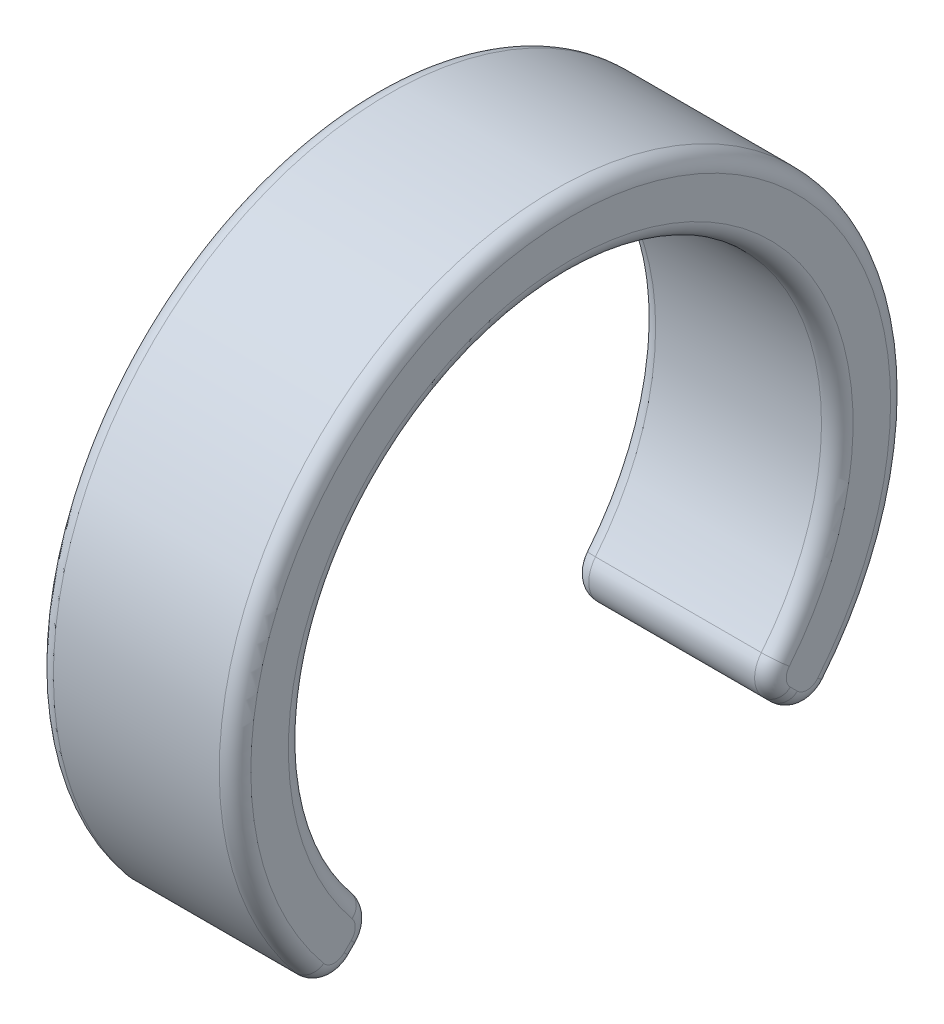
ISO-10303-21;
HEADER;
FILE_DESCRIPTION(('STEP AP214'),'2;1');
FILE_NAME('part.step','',(''),(''),'','','');
FILE_SCHEMA(('AUTOMOTIVE_DESIGN { 1 0 10303 214 1 1 1 1 }'));
ENDSEC;
DATA;
#1=APPLICATION_CONTEXT('core data for automotive mechanical design processes');
#2=APPLICATION_PROTOCOL_DEFINITION('international standard','automotive_design',2000,#1);
#3=PRODUCT_CONTEXT('',#1,'mechanical');
#4=PRODUCT('Part','Part','',(#3));
#5=PRODUCT_RELATED_PRODUCT_CATEGORY('part','',(#4));
#6=PRODUCT_DEFINITION_FORMATION('','',#4);
#7=PRODUCT_DEFINITION_CONTEXT('part definition',#1,'design');
#8=PRODUCT_DEFINITION('design','',#6,#7);
#9=PRODUCT_DEFINITION_SHAPE('','',#8);
#10=(LENGTH_UNIT() NAMED_UNIT(*) SI_UNIT(.MILLI.,.METRE.));
#11=(NAMED_UNIT(*) PLANE_ANGLE_UNIT() SI_UNIT($,.RADIAN.));
#12=(NAMED_UNIT(*) SI_UNIT($,.STERADIAN.) SOLID_ANGLE_UNIT());
#13=UNCERTAINTY_MEASURE_WITH_UNIT(LENGTH_MEASURE(1.E-05),#10,'distance_accuracy_value','');
#14=(GEOMETRIC_REPRESENTATION_CONTEXT(3) GLOBAL_UNCERTAINTY_ASSIGNED_CONTEXT((#13)) GLOBAL_UNIT_ASSIGNED_CONTEXT((#10,
#11,#12)) REPRESENTATION_CONTEXT('',''));
#15=CARTESIAN_POINT('',(0.,0.,0.));
#16=DIRECTION('',(0.,0.,1.));
#17=DIRECTION('',(1.,0.,0.));
#18=AXIS2_PLACEMENT_3D('',#15,#16,#17);
#19=CARTESIAN_POINT('',(5.,-12.0208152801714,12.0208152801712));
#20=DIRECTION('',(-1.,0.,0.));
#21=DIRECTION('',(0.,0.,1.));
#22=AXIS2_PLACEMENT_3D('',#19,#20,#21);
#23=PLANE('',#22);
#24=CARTESIAN_POINT('',(5.,0.,0.));
#25=DIRECTION('',(-1.,0.,0.));
#26=DIRECTION('',(0.,0.,1.));
#27=AXIS2_PLACEMENT_3D('',#24,#25,#26);
#28=CIRCLE('',#27,16.2);
#29=CARTESIAN_POINT('',(5.,-10.2928026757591,-12.5099245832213));
#30=VERTEX_POINT('',#29);
#31=CARTESIAN_POINT('',(5.,-10.2928026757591,12.5099245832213));
#32=VERTEX_POINT('',#31);
#33=EDGE_CURVE('E153',#30,#32,#28,.F.);
#34=ORIENTED_EDGE('',*,*,#33,.T.);
#35=CARTESIAN_POINT('',(5.,-9.84805194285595,11.9693722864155));
#36=DIRECTION('',(-1.,0.,0.));
#37=DIRECTION('',(0.,0.,1.));
#38=AXIS2_PLACEMENT_3D('',#35,#36,#37);
#39=CIRCLE('',#38,0.7);
#40=CARTESIAN_POINT('',(5.,-10.3430266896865,11.4743975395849));
#41=VERTEX_POINT('',#40);
#42=EDGE_CURVE('E190',#32,#41,#39,.F.);
#43=ORIENTED_EDGE('',*,*,#42,.T.);
#44=DIRECTION('',(0.,-0.707106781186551,0.707106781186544));
#45=VECTOR('',#44,1.);
#46=CARTESIAN_POINT('',(5.,-11.4551298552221,12.5865007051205));
#47=LINE('',#46,#45);
#48=CARTESIAN_POINT('',(5.,-9.98775003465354,11.1191208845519));
#49=VERTEX_POINT('',#48);
#50=EDGE_CURVE('E188',#41,#49,#47,.F.);
#51=ORIENTED_EDGE('',*,*,#50,.T.);
#52=CARTESIAN_POINT('',(5.,-9.49277528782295,11.6140956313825));
#53=DIRECTION('',(-1.,0.,0.));
#54=DIRECTION('',(0.,0.,1.));
#55=AXIS2_PLACEMENT_3D('',#52,#53,#54);
#56=CIRCLE('',#55,0.7);
#57=CARTESIAN_POINT('',(5.,-9.04977910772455,11.072104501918));
#58=VERTEX_POINT('',#57);
#59=EDGE_CURVE('E186',#49,#58,#56,.F.);
#60=ORIENTED_EDGE('',*,*,#59,.T.);
#61=CARTESIAN_POINT('',(5.,0.,0.));
#62=DIRECTION('',(-1.,0.,0.));
#63=DIRECTION('',(0.,0.,1.));
#64=AXIS2_PLACEMENT_3D('',#61,#62,#63);
#65=CIRCLE('',#64,14.3);
#66=CARTESIAN_POINT('',(5.,-9.04977910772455,-11.072104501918));
#67=VERTEX_POINT('',#66);
#68=EDGE_CURVE('E184',#58,#67,#65,.T.);
#69=ORIENTED_EDGE('',*,*,#68,.T.);
#70=CARTESIAN_POINT('',(5.,-9.49277528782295,-11.6140956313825));
#71=DIRECTION('',(-1.,0.,0.));
#72=DIRECTION('',(0.,0.,1.));
#73=AXIS2_PLACEMENT_3D('',#70,#71,#72);
#74=CIRCLE('',#73,0.7);
#75=CARTESIAN_POINT('',(5.,-9.98775003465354,-11.1191208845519));
#76=VERTEX_POINT('',#75);
#77=EDGE_CURVE('E182',#67,#76,#74,.F.);
#78=ORIENTED_EDGE('',*,*,#77,.T.);
#79=DIRECTION('',(0.,-0.707106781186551,-0.707106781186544));
#80=VECTOR('',#79,1.);
#81=CARTESIAN_POINT('',(5.,-10.3430266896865,-11.4743975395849));
#82=LINE('',#81,#80);
#83=CARTESIAN_POINT('',(5.,-10.3430266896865,-11.4743975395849));
#84=VERTEX_POINT('',#83);
#85=EDGE_CURVE('E156',#76,#84,#82,.T.);
#86=ORIENTED_EDGE('',*,*,#85,.T.);
#87=CARTESIAN_POINT('',(5.,-9.84805194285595,-11.9693722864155));
#88=DIRECTION('',(-1.,0.,0.));
#89=DIRECTION('',(0.,0.,1.));
#90=AXIS2_PLACEMENT_3D('',#87,#88,#89);
#91=CIRCLE('',#90,0.7);
#92=EDGE_CURVE('E149',#84,#30,#91,.F.);
#93=ORIENTED_EDGE('',*,*,#92,.T.);
#94=EDGE_LOOP('',(#34,#43,#51,#60,#69,#78,#86,#93));
#95=FACE_BOUND('',#94,.T.);
#96=ADVANCED_FACE('F34',(#95),#23,.F.);
#97=CARTESIAN_POINT('',(-29.230918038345,0.,0.));
#98=DIRECTION('',(-1.,0.,0.));
#99=DIRECTION('',(0.,0.,1.));
#100=AXIS2_PLACEMENT_3D('',#97,#98,#99);
#101=CYLINDRICAL_SURFACE('',#100,13.5);
#102=DIRECTION('',(-1.,0.,0.));
#103=VECTOR('',#102,1.);
#104=CARTESIAN_POINT('',(-29.230918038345,-8.54349775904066,-10.4526860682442));
#105=LINE('',#104,#103);
#106=CARTESIAN_POINT('',(-4.2,-8.54349775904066,-10.4526860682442));
#107=VERTEX_POINT('',#106);
#108=CARTESIAN_POINT('',(4.2,-8.54349775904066,-10.4526860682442));
#109=VERTEX_POINT('',#108);
#110=EDGE_CURVE('E305',#107,#109,#105,.F.);
#111=ORIENTED_EDGE('',*,*,#110,.T.);
#112=CARTESIAN_POINT('',(4.2,0.,0.));
#113=DIRECTION('',(-1.,0.,0.));
#114=DIRECTION('',(0.,0.,1.));
#115=AXIS2_PLACEMENT_3D('',#112,#113,#114);
#116=CIRCLE('',#115,13.5);
#117=CARTESIAN_POINT('',(4.2,-8.54349775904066,10.4526860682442));
#118=VERTEX_POINT('',#117);
#119=EDGE_CURVE('E208',#109,#118,#116,.F.);
#120=ORIENTED_EDGE('',*,*,#119,.T.);
#121=DIRECTION('',(-1.,0.,0.));
#122=VECTOR('',#121,1.);
#123=CARTESIAN_POINT('',(-29.230918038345,-8.54349775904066,10.4526860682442));
#124=LINE('',#123,#122);
#125=CARTESIAN_POINT('',(-4.2,-8.54349775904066,10.4526860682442));
#126=VERTEX_POINT('',#125);
#127=EDGE_CURVE('E302',#118,#126,#124,.T.);
#128=ORIENTED_EDGE('',*,*,#127,.T.);
#129=CARTESIAN_POINT('',(-4.2,0.,0.));
#130=DIRECTION('',(1.,0.,0.));
#131=DIRECTION('',(0.,0.,-1.));
#132=AXIS2_PLACEMENT_3D('',#129,#130,#131);
#133=CIRCLE('',#132,13.5);
#134=EDGE_CURVE('E206',#126,#107,#133,.F.);
#135=ORIENTED_EDGE('',*,*,#134,.T.);
#136=EDGE_LOOP('',(#111,#120,#128,#135));
#137=FACE_BOUND('',#136,.T.);
#138=ADVANCED_FACE('F336',(#137),#101,.F.);
#139=CARTESIAN_POINT('',(-5.,-12.0208152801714,12.0208152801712));
#140=DIRECTION('',(1.,0.,0.));
#141=DIRECTION('',(0.,0.,-1.));
#142=AXIS2_PLACEMENT_3D('',#139,#140,#141);
#143=PLANE('',#142);
#144=CARTESIAN_POINT('',(-5.,0.,0.));
#145=DIRECTION('',(1.,0.,0.));
#146=DIRECTION('',(0.,0.,-1.));
#147=AXIS2_PLACEMENT_3D('',#144,#145,#146);
#148=CIRCLE('',#147,14.3);
#149=CARTESIAN_POINT('',(-5.,-9.04977910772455,-11.072104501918));
#150=VERTEX_POINT('',#149);
#151=CARTESIAN_POINT('',(-5.,-9.04977910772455,11.072104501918));
#152=VERTEX_POINT('',#151);
#153=EDGE_CURVE('E221',#150,#152,#148,.T.);
#154=ORIENTED_EDGE('',*,*,#153,.T.);
#155=CARTESIAN_POINT('',(-5.,-9.49277528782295,11.6140956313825));
#156=DIRECTION('',(1.,0.,0.));
#157=DIRECTION('',(0.,0.,-1.));
#158=AXIS2_PLACEMENT_3D('',#155,#156,#157);
#159=CIRCLE('',#158,0.7);
#160=CARTESIAN_POINT('',(-5.,-9.98775003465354,11.1191208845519));
#161=VERTEX_POINT('',#160);
#162=EDGE_CURVE('E234',#152,#161,#159,.F.);
#163=ORIENTED_EDGE('',*,*,#162,.T.);
#164=DIRECTION('',(0.,0.707106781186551,-0.707106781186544));
#165=VECTOR('',#164,1.);
#166=CARTESIAN_POINT('',(-5.,-11.4551298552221,12.5865007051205));
#167=LINE('',#166,#165);
#168=CARTESIAN_POINT('',(-5.,-10.3430266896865,11.4743975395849));
#169=VERTEX_POINT('',#168);
#170=EDGE_CURVE('E58',#161,#169,#167,.F.);
#171=ORIENTED_EDGE('',*,*,#170,.T.);
#172=CARTESIAN_POINT('',(-5.,-9.84805194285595,11.9693722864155));
#173=DIRECTION('',(1.,0.,0.));
#174=DIRECTION('',(0.,0.,-1.));
#175=AXIS2_PLACEMENT_3D('',#172,#173,#174);
#176=CIRCLE('',#175,0.7);
#177=CARTESIAN_POINT('',(-5.,-10.2928026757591,12.5099245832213));
#178=VERTEX_POINT('',#177);
#179=EDGE_CURVE('E231',#169,#178,#176,.F.);
#180=ORIENTED_EDGE('',*,*,#179,.T.);
#181=CARTESIAN_POINT('',(-5.,0.,0.));
#182=DIRECTION('',(1.,0.,0.));
#183=DIRECTION('',(0.,0.,-1.));
#184=AXIS2_PLACEMENT_3D('',#181,#182,#183);
#185=CIRCLE('',#184,16.2);
#186=CARTESIAN_POINT('',(-5.,-10.2928026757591,-12.5099245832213));
#187=VERTEX_POINT('',#186);
#188=EDGE_CURVE('E229',#178,#187,#185,.F.);
#189=ORIENTED_EDGE('',*,*,#188,.T.);
#190=CARTESIAN_POINT('',(-5.,-9.84805194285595,-11.9693722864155));
#191=DIRECTION('',(1.,0.,0.));
#192=DIRECTION('',(0.,0.,-1.));
#193=AXIS2_PLACEMENT_3D('',#190,#191,#192);
#194=CIRCLE('',#193,0.7);
#195=CARTESIAN_POINT('',(-5.,-10.3430266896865,-11.4743975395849));
#196=VERTEX_POINT('',#195);
#197=EDGE_CURVE('E227',#187,#196,#194,.F.);
#198=ORIENTED_EDGE('',*,*,#197,.T.);
#199=DIRECTION('',(0.,0.707106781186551,0.707106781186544));
#200=VECTOR('',#199,1.);
#201=CARTESIAN_POINT('',(-5.,-9.98775003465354,-11.1191208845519));
#202=LINE('',#201,#200);
#203=CARTESIAN_POINT('',(-5.,-9.98775003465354,-11.1191208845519));
#204=VERTEX_POINT('',#203);
#205=EDGE_CURVE('E225',#196,#204,#202,.T.);
#206=ORIENTED_EDGE('',*,*,#205,.T.);
#207=CARTESIAN_POINT('',(-5.,-9.49277528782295,-11.6140956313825));
#208=DIRECTION('',(1.,0.,0.));
#209=DIRECTION('',(0.,0.,-1.));
#210=AXIS2_PLACEMENT_3D('',#207,#208,#209);
#211=CIRCLE('',#210,0.7);
#212=EDGE_CURVE('E223',#204,#150,#211,.F.);
#213=ORIENTED_EDGE('',*,*,#212,.T.);
#214=EDGE_LOOP('',(#154,#163,#171,#180,#189,#198,#206,#213));
#215=FACE_BOUND('',#214,.T.);
#216=ADVANCED_FACE('F322',(#215),#143,.F.);
#217=CARTESIAN_POINT('',(-29.230918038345,0.,0.));
#218=DIRECTION('',(-1.,0.,0.));
#219=DIRECTION('',(0.,0.,1.));
#220=AXIS2_PLACEMENT_3D('',#217,#218,#219);
#221=CYLINDRICAL_SURFACE('',#220,17.);
#222=DIRECTION('',(-1.,0.,0.));
#223=VECTOR('',#222,1.);
#224=CARTESIAN_POINT('',(-29.230918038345,-10.8010892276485,-13.1276986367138));
#225=LINE('',#224,#223);
#226=CARTESIAN_POINT('',(4.2,-10.8010892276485,-13.1276986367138));
#227=VERTEX_POINT('',#226);
#228=CARTESIAN_POINT('',(-4.2,-10.8010892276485,-13.1276986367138));
#229=VERTEX_POINT('',#228);
#230=EDGE_CURVE('E288',#227,#229,#225,.T.);
#231=ORIENTED_EDGE('',*,*,#230,.T.);
#232=CARTESIAN_POINT('',(-4.2,0.,0.));
#233=DIRECTION('',(1.,0.,0.));
#234=DIRECTION('',(0.,0.,-1.));
#235=AXIS2_PLACEMENT_3D('',#232,#233,#234);
#236=CIRCLE('',#235,17.);
#237=CARTESIAN_POINT('',(-4.2,-10.8010892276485,13.1276986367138));
#238=VERTEX_POINT('',#237);
#239=EDGE_CURVE('E11',#229,#238,#236,.T.);
#240=ORIENTED_EDGE('',*,*,#239,.T.);
#241=DIRECTION('',(-1.,0.,0.));
#242=VECTOR('',#241,1.);
#243=CARTESIAN_POINT('',(-29.230918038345,-10.8010892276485,13.1276986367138));
#244=LINE('',#243,#242);
#245=CARTESIAN_POINT('',(4.2,-10.8010892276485,13.1276986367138));
#246=VERTEX_POINT('',#245);
#247=EDGE_CURVE('E252',#238,#246,#244,.F.);
#248=ORIENTED_EDGE('',*,*,#247,.T.);
#249=CARTESIAN_POINT('',(4.2,0.,0.));
#250=DIRECTION('',(-1.,0.,0.));
#251=DIRECTION('',(0.,0.,1.));
#252=AXIS2_PLACEMENT_3D('',#249,#250,#251);
#253=CIRCLE('',#252,17.);
#254=EDGE_CURVE('E43',#246,#227,#253,.T.);
#255=ORIENTED_EDGE('',*,*,#254,.T.);
#256=EDGE_LOOP('',(#231,#240,#248,#255));
#257=FACE_BOUND('',#256,.T.);
#258=ADVANCED_FACE('F292',(#257),#221,.T.);
#259=CARTESIAN_POINT('',(0.,0.,0.));
#260=DIRECTION('',(0.,0.707106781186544,0.707106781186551));
#261=DIRECTION('',(-1.,0.,0.));
#262=AXIS2_PLACEMENT_3D('',#259,#260,#261);
#263=PLANE('',#262);
#264=DIRECTION('',(-1.,0.,0.));
#265=VECTOR('',#264,1.);
#266=CARTESIAN_POINT('',(0.,-10.5534354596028,10.5534354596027));
#267=LINE('',#266,#265);
#268=CARTESIAN_POINT('',(-4.2,-10.5534354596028,10.5534354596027));
#269=VERTEX_POINT('',#268);
#270=CARTESIAN_POINT('',(4.2,-10.5534354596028,10.5534354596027));
#271=VERTEX_POINT('',#270);
#272=EDGE_CURVE('E174',#269,#271,#267,.F.);
#273=ORIENTED_EDGE('',*,*,#272,.T.);
#274=DIRECTION('',(0.,-0.707106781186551,0.707106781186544));
#275=VECTOR('',#274,1.);
#276=CARTESIAN_POINT('',(4.2,0.,0.));
#277=LINE('',#276,#275);
#278=CARTESIAN_POINT('',(4.2,-10.9087121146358,10.9087121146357));
#279=VERTEX_POINT('',#278);
#280=EDGE_CURVE('E199',#271,#279,#277,.T.);
#281=ORIENTED_EDGE('',*,*,#280,.T.);
#282=DIRECTION('',(-1.,0.,0.));
#283=VECTOR('',#282,1.);
#284=CARTESIAN_POINT('',(0.,-10.9087121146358,10.9087121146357));
#285=LINE('',#284,#283);
#286=CARTESIAN_POINT('',(-4.2,-10.9087121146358,10.9087121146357));
#287=VERTEX_POINT('',#286);
#288=EDGE_CURVE('E177',#279,#287,#285,.T.);
#289=ORIENTED_EDGE('',*,*,#288,.T.);
#290=DIRECTION('',(0.,0.707106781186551,-0.707106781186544));
#291=VECTOR('',#290,1.);
#292=CARTESIAN_POINT('',(-4.2,0.,0.));
#293=LINE('',#292,#291);
#294=EDGE_CURVE('E197',#287,#269,#293,.T.);
#295=ORIENTED_EDGE('',*,*,#294,.T.);
#296=EDGE_LOOP('',(#273,#281,#289,#295));
#297=FACE_BOUND('',#296,.T.);
#298=ADVANCED_FACE('F311',(#297),#263,.F.);
#299=CARTESIAN_POINT('',(0.,0.,0.));
#300=DIRECTION('',(0.,-0.707106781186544,0.707106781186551));
#301=DIRECTION('',(-1.,0.,0.));
#302=AXIS2_PLACEMENT_3D('',#299,#300,#301);
#303=PLANE('',#302);
#304=DIRECTION('',(1.,0.,0.));
#305=VECTOR('',#304,1.);
#306=CARTESIAN_POINT('',(5.,-10.9087121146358,-10.9087121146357));
#307=LINE('',#306,#305);
#308=CARTESIAN_POINT('',(-4.2,-10.9087121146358,-10.9087121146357));
#309=VERTEX_POINT('',#308);
#310=CARTESIAN_POINT('',(4.2,-10.9087121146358,-10.9087121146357));
#311=VERTEX_POINT('',#310);
#312=EDGE_CURVE('E290',#309,#311,#307,.T.);
#313=ORIENTED_EDGE('',*,*,#312,.T.);
#314=DIRECTION('',(0.,-0.707106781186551,-0.707106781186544));
#315=VECTOR('',#314,1.);
#316=CARTESIAN_POINT('',(4.2,-10.5534354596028,-10.5534354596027));
#317=LINE('',#316,#315);
#318=CARTESIAN_POINT('',(4.2,-10.5534354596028,-10.5534354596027));
#319=VERTEX_POINT('',#318);
#320=EDGE_CURVE('E216',#311,#319,#317,.F.);
#321=ORIENTED_EDGE('',*,*,#320,.T.);
#322=DIRECTION('',(1.,0.,0.));
#323=VECTOR('',#322,1.);
#324=CARTESIAN_POINT('',(-4.99999999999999,-10.5534354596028,-10.5534354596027));
#325=LINE('',#324,#323);
#326=CARTESIAN_POINT('',(-4.2,-10.5534354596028,-10.5534354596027));
#327=VERTEX_POINT('',#326);
#328=EDGE_CURVE('E295',#319,#327,#325,.F.);
#329=ORIENTED_EDGE('',*,*,#328,.T.);
#330=DIRECTION('',(0.,0.707106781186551,0.707106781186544));
#331=VECTOR('',#330,1.);
#332=CARTESIAN_POINT('',(-4.2,-10.9087121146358,-10.9087121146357));
#333=LINE('',#332,#331);
#334=EDGE_CURVE('E214',#327,#309,#333,.F.);
#335=ORIENTED_EDGE('',*,*,#334,.T.);
#336=EDGE_LOOP('',(#313,#321,#329,#335));
#337=FACE_BOUND('',#336,.T.);
#338=ADVANCED_FACE('F365',(#337),#303,.T.);
#339=CARTESIAN_POINT('',(-29.230918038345,-9.84805194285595,-11.9693722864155));
#340=DIRECTION('',(-1.,0.,0.));
#341=DIRECTION('',(0.,0.,1.));
#342=AXIS2_PLACEMENT_3D('',#339,#340,#341);
#343=CYLINDRICAL_SURFACE('',#342,1.5);
#344=ORIENTED_EDGE('',*,*,#230,.F.);
#345=CARTESIAN_POINT('',(4.2,-9.84805194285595,-11.9693722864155));
#346=DIRECTION('',(-1.,0.,0.));
#347=DIRECTION('',(0.,0.,1.));
#348=AXIS2_PLACEMENT_3D('',#345,#346,#347);
#349=CIRCLE('',#348,1.5);
#350=EDGE_CURVE('E165',#227,#311,#349,.T.);
#351=ORIENTED_EDGE('',*,*,#350,.T.);
#352=ORIENTED_EDGE('',*,*,#312,.F.);
#353=CARTESIAN_POINT('',(-4.2,-9.84805194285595,-11.9693722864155));
#354=DIRECTION('',(1.,0.,0.));
#355=DIRECTION('',(0.,0.,-1.));
#356=AXIS2_PLACEMENT_3D('',#353,#354,#355);
#357=CIRCLE('',#356,1.5);
#358=EDGE_CURVE('E218',#309,#229,#357,.T.);
#359=ORIENTED_EDGE('',*,*,#358,.T.);
#360=EDGE_LOOP('',(#344,#351,#352,#359));
#361=FACE_BOUND('',#360,.T.);
#362=ADVANCED_FACE('F287',(#361),#343,.T.);
#363=CARTESIAN_POINT('',(-29.230918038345,-9.49277528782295,-11.6140956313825));
#364=DIRECTION('',(-1.,0.,0.));
#365=DIRECTION('',(0.,0.,1.));
#366=AXIS2_PLACEMENT_3D('',#363,#364,#365);
#367=CYLINDRICAL_SURFACE('',#366,1.5);
#368=ORIENTED_EDGE('',*,*,#328,.F.);
#369=CARTESIAN_POINT('',(4.2,-9.49277528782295,-11.6140956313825));
#370=DIRECTION('',(-1.,0.,0.));
#371=DIRECTION('',(0.,0.,1.));
#372=AXIS2_PLACEMENT_3D('',#369,#370,#371);
#373=CIRCLE('',#372,1.5);
#374=EDGE_CURVE('E212',#319,#109,#373,.T.);
#375=ORIENTED_EDGE('',*,*,#374,.T.);
#376=ORIENTED_EDGE('',*,*,#110,.F.);
#377=CARTESIAN_POINT('',(-4.2,-9.49277528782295,-11.6140956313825));
#378=DIRECTION('',(1.,0.,0.));
#379=DIRECTION('',(0.,0.,-1.));
#380=AXIS2_PLACEMENT_3D('',#377,#378,#379);
#381=CIRCLE('',#380,1.5);
#382=EDGE_CURVE('E210',#107,#327,#381,.T.);
#383=ORIENTED_EDGE('',*,*,#382,.T.);
#384=EDGE_LOOP('',(#368,#375,#376,#383));
#385=FACE_BOUND('',#384,.T.);
#386=ADVANCED_FACE('F362',(#385),#367,.T.);
#387=CARTESIAN_POINT('',(-29.230918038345,-9.49277528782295,11.6140956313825));
#388=DIRECTION('',(-1.,0.,0.));
#389=DIRECTION('',(0.,0.,1.));
#390=AXIS2_PLACEMENT_3D('',#387,#388,#389);
#391=CYLINDRICAL_SURFACE('',#390,1.5);
#392=ORIENTED_EDGE('',*,*,#127,.F.);
#393=CARTESIAN_POINT('',(4.2,-9.49277528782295,11.6140956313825));
#394=DIRECTION('',(-1.,0.,0.));
#395=DIRECTION('',(0.,0.,1.));
#396=AXIS2_PLACEMENT_3D('',#393,#394,#395);
#397=CIRCLE('',#396,1.5);
#398=EDGE_CURVE('E204',#118,#271,#397,.T.);
#399=ORIENTED_EDGE('',*,*,#398,.T.);
#400=ORIENTED_EDGE('',*,*,#272,.F.);
#401=CARTESIAN_POINT('',(-4.2,-9.49277528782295,11.6140956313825));
#402=DIRECTION('',(1.,0.,0.));
#403=DIRECTION('',(0.,0.,-1.));
#404=AXIS2_PLACEMENT_3D('',#401,#402,#403);
#405=CIRCLE('',#404,1.5);
#406=EDGE_CURVE('E201',#269,#126,#405,.T.);
#407=ORIENTED_EDGE('',*,*,#406,.T.);
#408=EDGE_LOOP('',(#392,#399,#400,#407));
#409=FACE_BOUND('',#408,.T.);
#410=ADVANCED_FACE('F334',(#409),#391,.T.);
#411=CARTESIAN_POINT('',(-29.230918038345,-9.84805194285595,11.9693722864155));
#412=DIRECTION('',(-1.,0.,0.));
#413=DIRECTION('',(0.,0.,1.));
#414=AXIS2_PLACEMENT_3D('',#411,#412,#413);
#415=CYLINDRICAL_SURFACE('',#414,1.5);
#416=ORIENTED_EDGE('',*,*,#288,.F.);
#417=CARTESIAN_POINT('',(4.2,-9.84805194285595,11.9693722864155));
#418=DIRECTION('',(-1.,0.,0.));
#419=DIRECTION('',(0.,0.,1.));
#420=AXIS2_PLACEMENT_3D('',#417,#418,#419);
#421=CIRCLE('',#420,1.5);
#422=EDGE_CURVE('E194',#279,#246,#421,.T.);
#423=ORIENTED_EDGE('',*,*,#422,.T.);
#424=ORIENTED_EDGE('',*,*,#247,.F.);
#425=CARTESIAN_POINT('',(-4.2,-9.84805194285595,11.9693722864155));
#426=DIRECTION('',(1.,0.,0.));
#427=DIRECTION('',(0.,0.,-1.));
#428=AXIS2_PLACEMENT_3D('',#425,#426,#427);
#429=CIRCLE('',#428,1.5);
#430=EDGE_CURVE('E192',#238,#287,#429,.T.);
#431=ORIENTED_EDGE('',*,*,#430,.T.);
#432=EDGE_LOOP('',(#416,#423,#424,#431));
#433=FACE_BOUND('',#432,.T.);
#434=ADVANCED_FACE('F353',(#433),#415,.T.);
#435=CARTESIAN_POINT('',(4.2,-9.49277528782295,-11.6140956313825));
#436=DIRECTION('',(-1.,0.,0.));
#437=DIRECTION('',(0.,0.,1.));
#438=AXIS2_PLACEMENT_3D('',#435,#436,#437);
#439=DEGENERATE_TOROIDAL_SURFACE('',#438,0.7,0.8,.T.);
#440=CARTESIAN_POINT('',(4.2,-9.04977910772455,-11.072104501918));
#441=DIRECTION('',(0.,0.774273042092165,-0.632851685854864));
#442=DIRECTION('',(0.,0.632851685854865,0.774273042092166));
#443=AXIS2_PLACEMENT_3D('',#440,#441,#442);
#444=CIRCLE('',#443,0.8);
#445=EDGE_CURVE('E246',#109,#67,#444,.T.);
#446=ORIENTED_EDGE('',*,*,#445,.F.);
#447=ORIENTED_EDGE('',*,*,#374,.F.);
#448=CARTESIAN_POINT('',(4.2,-9.98775003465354,-11.1191208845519));
#449=DIRECTION('',(0.,-0.707106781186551,-0.707106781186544));
#450=DIRECTION('',(0.,0.707106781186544,-0.707106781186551));
#451=AXIS2_PLACEMENT_3D('',#448,#449,#450);
#452=CIRCLE('',#451,0.8);
#453=EDGE_CURVE('E249',#76,#319,#452,.T.);
#454=ORIENTED_EDGE('',*,*,#453,.F.);
#455=ORIENTED_EDGE('',*,*,#77,.F.);
#456=EDGE_LOOP('',(#446,#447,#454,#455));
#457=FACE_BOUND('',#456,.T.);
#458=ADVANCED_FACE('F372',(#457),#439,.T.);
#459=CARTESIAN_POINT('',(4.2,0.565685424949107,-0.565685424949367));
#460=DIRECTION('',(0.,0.707106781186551,0.707106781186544));
#461=DIRECTION('',(0.,-0.707106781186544,0.707106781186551));
#462=AXIS2_PLACEMENT_3D('',#459,#460,#461);
#463=CYLINDRICAL_SURFACE('',#462,0.8);
#464=ORIENTED_EDGE('',*,*,#453,.T.);
#465=ORIENTED_EDGE('',*,*,#320,.F.);
#466=CARTESIAN_POINT('',(4.2,-10.3430266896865,-11.4743975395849));
#467=DIRECTION('',(0.,-0.707106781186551,-0.707106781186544));
#468=DIRECTION('',(0.,0.707106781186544,-0.707106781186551));
#469=AXIS2_PLACEMENT_3D('',#466,#467,#468);
#470=CIRCLE('',#469,0.8);
#471=EDGE_CURVE('E244',#84,#311,#470,.T.);
#472=ORIENTED_EDGE('',*,*,#471,.F.);
#473=ORIENTED_EDGE('',*,*,#85,.F.);
#474=EDGE_LOOP('',(#464,#465,#472,#473));
#475=FACE_BOUND('',#474,.T.);
#476=ADVANCED_FACE('F368',(#475),#463,.T.);
#477=CARTESIAN_POINT('',(4.2,0.,0.));
#478=DIRECTION('',(-1.,0.,0.));
#479=DIRECTION('',(0.,0.,1.));
#480=AXIS2_PLACEMENT_3D('',#477,#478,#479);
#481=TOROIDAL_SURFACE('',#480,14.3,0.8);
#482=ORIENTED_EDGE('',*,*,#445,.T.);
#483=ORIENTED_EDGE('',*,*,#68,.F.);
#484=CARTESIAN_POINT('',(4.2,-9.04977910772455,11.072104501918));
#485=DIRECTION('',(0.,-0.774273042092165,-0.632851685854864));
#486=DIRECTION('',(0.,0.632851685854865,-0.774273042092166));
#487=AXIS2_PLACEMENT_3D('',#484,#485,#486);
#488=CIRCLE('',#487,0.8);
#489=EDGE_CURVE('E168',#118,#58,#488,.T.);
#490=ORIENTED_EDGE('',*,*,#489,.F.);
#491=ORIENTED_EDGE('',*,*,#119,.F.);
#492=EDGE_LOOP('',(#482,#483,#490,#491));
#493=FACE_BOUND('',#492,.T.);
#494=ADVANCED_FACE('F340',(#493),#481,.T.);
#495=CARTESIAN_POINT('',(4.2,-9.84805194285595,-11.9693722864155));
#496=DIRECTION('',(-1.,0.,0.));
#497=DIRECTION('',(0.,0.,1.));
#498=AXIS2_PLACEMENT_3D('',#495,#496,#497);
#499=DEGENERATE_TOROIDAL_SURFACE('',#498,0.7,0.8,.T.);
#500=ORIENTED_EDGE('',*,*,#471,.T.);
#501=ORIENTED_EDGE('',*,*,#350,.F.);
#502=CARTESIAN_POINT('',(4.2,-10.2928026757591,-12.5099245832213));
#503=DIRECTION('',(0.,0.772217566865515,-0.635358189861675));
#504=DIRECTION('',(0.,0.635358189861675,0.772217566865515));
#505=AXIS2_PLACEMENT_3D('',#502,#503,#504);
#506=CIRCLE('',#505,0.8);
#507=EDGE_CURVE('E163',#30,#227,#506,.T.);
#508=ORIENTED_EDGE('',*,*,#507,.F.);
#509=ORIENTED_EDGE('',*,*,#92,.F.);
#510=EDGE_LOOP('',(#500,#501,#508,#509));
#511=FACE_BOUND('',#510,.T.);
#512=ADVANCED_FACE('F164',(#511),#499,.T.);
#513=CARTESIAN_POINT('',(4.2,-9.49277528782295,11.6140956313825));
#514=DIRECTION('',(-1.,0.,0.));
#515=DIRECTION('',(0.,0.,1.));
#516=AXIS2_PLACEMENT_3D('',#513,#514,#515);
#517=DEGENERATE_TOROIDAL_SURFACE('',#516,0.7,0.8,.T.);
#518=ORIENTED_EDGE('',*,*,#489,.T.);
#519=ORIENTED_EDGE('',*,*,#59,.F.);
#520=CARTESIAN_POINT('',(4.2,-9.98775003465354,11.1191208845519));
#521=DIRECTION('',(0.,-0.707106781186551,0.707106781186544));
#522=DIRECTION('',(0.,-0.707106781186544,-0.707106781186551));
#523=AXIS2_PLACEMENT_3D('',#520,#521,#522);
#524=CIRCLE('',#523,0.8);
#525=EDGE_CURVE('E169',#271,#49,#524,.T.);
#526=ORIENTED_EDGE('',*,*,#525,.F.);
#527=ORIENTED_EDGE('',*,*,#398,.F.);
#528=EDGE_LOOP('',(#518,#519,#526,#527));
#529=FACE_BOUND('',#528,.T.);
#530=ADVANCED_FACE('F346',(#529),#517,.T.);
#531=CARTESIAN_POINT('',(4.2,0.,0.));
#532=DIRECTION('',(-1.,0.,0.));
#533=DIRECTION('',(0.,0.,1.));
#534=AXIS2_PLACEMENT_3D('',#531,#532,#533);
#535=TOROIDAL_SURFACE('',#534,16.2,0.8);
#536=ORIENTED_EDGE('',*,*,#507,.T.);
#537=ORIENTED_EDGE('',*,*,#254,.F.);
#538=CARTESIAN_POINT('',(4.2,-10.2928026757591,12.5099245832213));
#539=DIRECTION('',(0.,-0.772217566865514,-0.635358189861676));
#540=DIRECTION('',(0.,0.635358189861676,-0.772217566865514));
#541=AXIS2_PLACEMENT_3D('',#538,#539,#540);
#542=CIRCLE('',#541,0.8);
#543=EDGE_CURVE('E172',#32,#246,#542,.T.);
#544=ORIENTED_EDGE('',*,*,#543,.F.);
#545=ORIENTED_EDGE('',*,*,#33,.F.);
#546=EDGE_LOOP('',(#536,#537,#544,#545));
#547=FACE_BOUND('',#546,.T.);
#548=ADVANCED_FACE('F171',(#547),#535,.T.);
#549=CARTESIAN_POINT('',(4.2,0.565685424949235,0.565685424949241));
#550=DIRECTION('',(0.,-0.707106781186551,0.707106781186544));
#551=DIRECTION('',(0.,-0.707106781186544,-0.707106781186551));
#552=AXIS2_PLACEMENT_3D('',#549,#550,#551);
#553=CYLINDRICAL_SURFACE('',#552,0.8);
#554=ORIENTED_EDGE('',*,*,#525,.T.);
#555=ORIENTED_EDGE('',*,*,#50,.F.);
#556=CARTESIAN_POINT('',(4.2,-10.3430266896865,11.4743975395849));
#557=DIRECTION('',(0.,-0.707106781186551,0.707106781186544));
#558=DIRECTION('',(0.,-0.707106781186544,-0.707106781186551));
#559=AXIS2_PLACEMENT_3D('',#556,#557,#558);
#560=CIRCLE('',#559,0.8);
#561=EDGE_CURVE('E237',#279,#41,#560,.T.);
#562=ORIENTED_EDGE('',*,*,#561,.F.);
#563=ORIENTED_EDGE('',*,*,#280,.F.);
#564=EDGE_LOOP('',(#554,#555,#562,#563));
#565=FACE_BOUND('',#564,.T.);
#566=ADVANCED_FACE('F350',(#565),#553,.T.);
#567=CARTESIAN_POINT('',(4.2,-9.84805194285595,11.9693722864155));
#568=DIRECTION('',(-1.,0.,0.));
#569=DIRECTION('',(0.,0.,1.));
#570=AXIS2_PLACEMENT_3D('',#567,#568,#569);
#571=DEGENERATE_TOROIDAL_SURFACE('',#570,0.7,0.8,.T.);
#572=ORIENTED_EDGE('',*,*,#543,.T.);
#573=ORIENTED_EDGE('',*,*,#422,.F.);
#574=ORIENTED_EDGE('',*,*,#561,.T.);
#575=ORIENTED_EDGE('',*,*,#42,.F.);
#576=EDGE_LOOP('',(#572,#573,#574,#575));
#577=FACE_BOUND('',#576,.T.);
#578=ADVANCED_FACE('F352',(#577),#571,.T.);
#579=CARTESIAN_POINT('',(-4.2,-9.84805194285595,-11.9693722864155));
#580=DIRECTION('',(1.,0.,0.));
#581=DIRECTION('',(0.,0.,-1.));
#582=AXIS2_PLACEMENT_3D('',#579,#580,#581);
#583=DEGENERATE_TOROIDAL_SURFACE('',#582,0.7,0.8,.T.);
#584=CARTESIAN_POINT('',(-4.2,-10.2928026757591,-12.5099245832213));
#585=DIRECTION('',(0.,0.772217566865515,-0.635358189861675));
#586=DIRECTION('',(0.,0.635358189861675,0.772217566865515));
#587=AXIS2_PLACEMENT_3D('',#584,#585,#586);
#588=CIRCLE('',#587,0.8);
#589=EDGE_CURVE('E267',#229,#187,#588,.T.);
#590=ORIENTED_EDGE('',*,*,#589,.F.);
#591=ORIENTED_EDGE('',*,*,#358,.F.);
#592=CARTESIAN_POINT('',(-4.2,-10.3430266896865,-11.4743975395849));
#593=DIRECTION('',(0.,0.707106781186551,0.707106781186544));
#594=DIRECTION('',(0.,-0.707106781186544,0.707106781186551));
#595=AXIS2_PLACEMENT_3D('',#592,#593,#594);
#596=CIRCLE('',#595,0.8);
#597=EDGE_CURVE('E38',#196,#309,#596,.T.);
#598=ORIENTED_EDGE('',*,*,#597,.F.);
#599=ORIENTED_EDGE('',*,*,#197,.F.);
#600=EDGE_LOOP('',(#590,#591,#598,#599));
#601=FACE_BOUND('',#600,.T.);
#602=ADVANCED_FACE('F36',(#601),#583,.T.);
#603=CARTESIAN_POINT('',(-4.2,0.565685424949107,-0.565685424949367));
#604=DIRECTION('',(0.,-0.707106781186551,-0.707106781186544));
#605=DIRECTION('',(0.,0.707106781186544,-0.707106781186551));
#606=AXIS2_PLACEMENT_3D('',#603,#604,#605);
#607=CYLINDRICAL_SURFACE('',#606,0.8);
#608=ORIENTED_EDGE('',*,*,#597,.T.);
#609=ORIENTED_EDGE('',*,*,#334,.F.);
#610=CARTESIAN_POINT('',(-4.2,-9.98775003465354,-11.1191208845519));
#611=DIRECTION('',(0.,0.707106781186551,0.707106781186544));
#612=DIRECTION('',(0.,-0.707106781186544,0.707106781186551));
#613=AXIS2_PLACEMENT_3D('',#610,#611,#612);
#614=CIRCLE('',#613,0.8);
#615=EDGE_CURVE('E265',#204,#327,#614,.T.);
#616=ORIENTED_EDGE('',*,*,#615,.F.);
#617=ORIENTED_EDGE('',*,*,#205,.F.);
#618=EDGE_LOOP('',(#608,#609,#616,#617));
#619=FACE_BOUND('',#618,.T.);
#620=ADVANCED_FACE('F278',(#619),#607,.T.);
#621=CARTESIAN_POINT('',(-4.2,0.,0.));
#622=DIRECTION('',(1.,0.,0.));
#623=DIRECTION('',(0.,0.,-1.));
#624=AXIS2_PLACEMENT_3D('',#621,#622,#623);
#625=TOROIDAL_SURFACE('',#624,16.2,0.8);
#626=ORIENTED_EDGE('',*,*,#589,.T.);
#627=ORIENTED_EDGE('',*,*,#188,.F.);
#628=CARTESIAN_POINT('',(-4.2,-10.2928026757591,12.5099245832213));
#629=DIRECTION('',(0.,-0.772217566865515,-0.635358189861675));
#630=DIRECTION('',(0.,0.635358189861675,-0.772217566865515));
#631=AXIS2_PLACEMENT_3D('',#628,#629,#630);
#632=CIRCLE('',#631,0.8);
#633=EDGE_CURVE('E262',#238,#178,#632,.T.);
#634=ORIENTED_EDGE('',*,*,#633,.F.);
#635=ORIENTED_EDGE('',*,*,#239,.F.);
#636=EDGE_LOOP('',(#626,#627,#634,#635));
#637=FACE_BOUND('',#636,.T.);
#638=ADVANCED_FACE('F355',(#637),#625,.T.);
#639=CARTESIAN_POINT('',(-4.2,-9.49277528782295,-11.6140956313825));
#640=DIRECTION('',(1.,0.,0.));
#641=DIRECTION('',(0.,0.,-1.));
#642=AXIS2_PLACEMENT_3D('',#639,#640,#641);
#643=DEGENERATE_TOROIDAL_SURFACE('',#642,0.7,0.8,.T.);
#644=ORIENTED_EDGE('',*,*,#615,.T.);
#645=ORIENTED_EDGE('',*,*,#382,.F.);
#646=CARTESIAN_POINT('',(-4.2,-9.04977910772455,-11.072104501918));
#647=DIRECTION('',(0.,0.774273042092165,-0.632851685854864));
#648=DIRECTION('',(0.,0.632851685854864,0.774273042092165));
#649=AXIS2_PLACEMENT_3D('',#646,#647,#648);
#650=CIRCLE('',#649,0.8);
#651=EDGE_CURVE('E259',#150,#107,#650,.T.);
#652=ORIENTED_EDGE('',*,*,#651,.F.);
#653=ORIENTED_EDGE('',*,*,#212,.F.);
#654=EDGE_LOOP('',(#644,#645,#652,#653));
#655=FACE_BOUND('',#654,.T.);
#656=ADVANCED_FACE('F359',(#655),#643,.T.);
#657=CARTESIAN_POINT('',(-4.2,-9.84805194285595,11.9693722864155));
#658=DIRECTION('',(1.,0.,0.));
#659=DIRECTION('',(0.,0.,-1.));
#660=AXIS2_PLACEMENT_3D('',#657,#658,#659);
#661=DEGENERATE_TOROIDAL_SURFACE('',#660,0.7,0.8,.T.);
#662=ORIENTED_EDGE('',*,*,#633,.T.);
#663=ORIENTED_EDGE('',*,*,#179,.F.);
#664=CARTESIAN_POINT('',(-4.2,-10.3430266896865,11.4743975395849));
#665=DIRECTION('',(0.,0.707106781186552,-0.707106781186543));
#666=DIRECTION('',(0.,0.707106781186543,0.707106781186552));
#667=AXIS2_PLACEMENT_3D('',#664,#665,#666);
#668=CIRCLE('',#667,0.8);
#669=EDGE_CURVE('E256',#287,#169,#668,.T.);
#670=ORIENTED_EDGE('',*,*,#669,.F.);
#671=ORIENTED_EDGE('',*,*,#430,.F.);
#672=EDGE_LOOP('',(#662,#663,#670,#671));
#673=FACE_BOUND('',#672,.T.);
#674=ADVANCED_FACE('F319',(#673),#661,.T.);
#675=CARTESIAN_POINT('',(-4.2,0.,0.));
#676=DIRECTION('',(1.,0.,0.));
#677=DIRECTION('',(0.,0.,-1.));
#678=AXIS2_PLACEMENT_3D('',#675,#676,#677);
#679=TOROIDAL_SURFACE('',#678,14.3,0.8);
#680=ORIENTED_EDGE('',*,*,#651,.T.);
#681=ORIENTED_EDGE('',*,*,#134,.F.);
#682=CARTESIAN_POINT('',(-4.2,-9.04977910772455,11.072104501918));
#683=DIRECTION('',(0.,-0.774273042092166,-0.632851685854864));
#684=DIRECTION('',(0.,0.632851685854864,-0.774273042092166));
#685=AXIS2_PLACEMENT_3D('',#682,#683,#684);
#686=CIRCLE('',#685,0.8);
#687=EDGE_CURVE('E254',#152,#126,#686,.T.);
#688=ORIENTED_EDGE('',*,*,#687,.F.);
#689=ORIENTED_EDGE('',*,*,#153,.F.);
#690=EDGE_LOOP('',(#680,#681,#688,#689));
#691=FACE_BOUND('',#690,.T.);
#692=ADVANCED_FACE('F328',(#691),#679,.T.);
#693=CARTESIAN_POINT('',(-4.2,0.565685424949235,0.565685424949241));
#694=DIRECTION('',(0.,0.707106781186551,-0.707106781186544));
#695=DIRECTION('',(0.,0.707106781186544,0.707106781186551));
#696=AXIS2_PLACEMENT_3D('',#693,#694,#695);
#697=CYLINDRICAL_SURFACE('',#696,0.8);
#698=ORIENTED_EDGE('',*,*,#669,.T.);
#699=ORIENTED_EDGE('',*,*,#170,.F.);
#700=CARTESIAN_POINT('',(-4.2,-9.98775003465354,11.1191208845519));
#701=DIRECTION('',(0.,0.707106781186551,-0.707106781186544));
#702=DIRECTION('',(0.,0.707106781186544,0.707106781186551));
#703=AXIS2_PLACEMENT_3D('',#700,#701,#702);
#704=CIRCLE('',#703,0.8);
#705=EDGE_CURVE('E51',#269,#161,#704,.T.);
#706=ORIENTED_EDGE('',*,*,#705,.F.);
#707=ORIENTED_EDGE('',*,*,#294,.F.);
#708=EDGE_LOOP('',(#698,#699,#706,#707));
#709=FACE_BOUND('',#708,.T.);
#710=ADVANCED_FACE('F321',(#709),#697,.T.);
#711=CARTESIAN_POINT('',(-4.2,-9.49277528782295,11.6140956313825));
#712=DIRECTION('',(1.,0.,0.));
#713=DIRECTION('',(0.,0.,-1.));
#714=AXIS2_PLACEMENT_3D('',#711,#712,#713);
#715=DEGENERATE_TOROIDAL_SURFACE('',#714,0.7,0.8,.T.);
#716=ORIENTED_EDGE('',*,*,#687,.T.);
#717=ORIENTED_EDGE('',*,*,#406,.F.);
#718=ORIENTED_EDGE('',*,*,#705,.T.);
#719=ORIENTED_EDGE('',*,*,#162,.F.);
#720=EDGE_LOOP('',(#716,#717,#718,#719));
#721=FACE_BOUND('',#720,.T.);
#722=ADVANCED_FACE('F325',(#721),#715,.T.);
#723=CLOSED_SHELL('',(#96,#138,#216,#258,#298,#338,#362,#386,#410,#434,#458,#476,#494,#512,#530,
#548,#566,#578,#602,#620,#638,#656,#674,#692,#710,#722));
#724=MANIFOLD_SOLID_BREP('B2',#723);
#725=ADVANCED_BREP_SHAPE_REPRESENTATION('',(#18,#724),#14);
#726=SHAPE_DEFINITION_REPRESENTATION(#9,#725);
ENDSEC;
END-ISO-10303-21;
